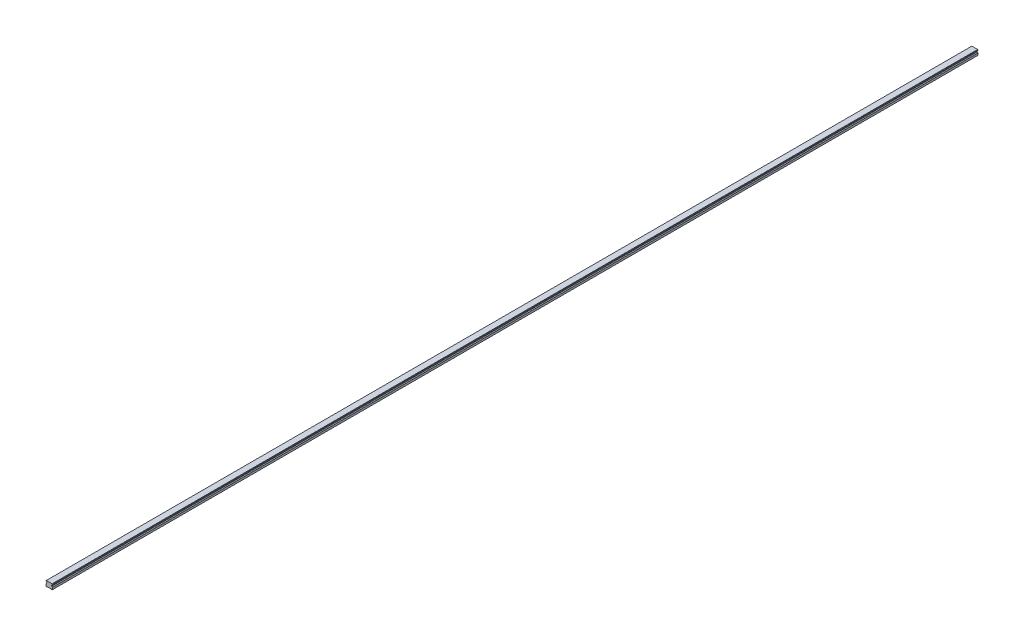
from build123d import *

# Parameters (mm, degrees)
SKETCH1_W           = 20
SKETCH1_H           = 16.3
BOSS_EXTRUDE1_DEPTH = 1430
CUT_EXTRUDE1_DEPTH  = 2861.063931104
CHAMFER1_SIZE       = 1
FILLET1_R           = 1
CUT_EXTRUDE2_DEPTH  = 2861.063931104
SKETCH5_R           = 3
SKETCH5_R_2         = 2.5
CUT_EXTRUDE5_DEPTH  = 10
SKETCH5_2_R         = 2.5
CUT_EXTRUDE6_DEPTH  = 13
LPATTERN2_COUNT     = 48
LPATTERN2_PITCH     = 60


with BuildPart() as part:
    # Sketch1 → Boss-Extrude1 (new, symmetric)
    with BuildSketch(Plane.XY):
        with Locations((0, 8.15)):
            Rectangle(SKETCH1_W, SKETCH1_H)
    extrude(amount=BOSS_EXTRUDE1_DEPTH, both=True)

    # Sketch2 → Cut-Extrude1 (cut, through all)
    with BuildSketch(Plane.XY.offset(1430)):
        Polygon((-10, 14.3), (-10, 7.3), (-7.666666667, 9.633333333), (-7.666666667, 11.966666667), align=None)
        Polygon((7.666666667, 11.966666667), (10, 14.3), (10, 7.3), (7.666666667, 9.633333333), align=None)
    extrude(amount=-CUT_EXTRUDE1_DEPTH, mode=Mode.SUBTRACT)

    # Chamfer1
    chamfer1_edges = [part.edges().sort_by_distance(p)[0] for p in [
        (-10, 16.3, 0),
        (10, 16.3, 0),
        (10, 0, 0),
        (-10, 0, 0),
    ]]
    chamfer(chamfer1_edges, length=CHAMFER1_SIZE)

    # Fillet1
    fillet1_edges = [part.edges().sort_by_distance(p)[0] for p in [
        (-7.666666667, 11.966666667, 0),
        (-7.666666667, 9.633333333, 0),
        (7.666666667, 9.633333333, 0),
        (7.666666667, 11.966666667, 0),
    ]]
    fillet(fillet1_edges, radius=FILLET1_R)

    # Sketch3 → Cut-Extrude2 (cut, through all)
    with BuildSketch(Plane.XY.offset(1430)):
        Polygon((-6, 0), (-5, 1), (5, 1), (6, 0), align=None)
    extrude(amount=-CUT_EXTRUDE2_DEPTH, mode=Mode.SUBTRACT)

    # Sketch5 → Cut-Extrude5 (cut)
    with BuildSketch(Plane.XZ.offset(-1)):
        with Locations(Location((0, 1410, 0), (0, 0, 270))):
            Circle(SKETCH5_R)
        with Locations(Location((0, 1410, 0), (0, 0, 270))):
            Circle(SKETCH5_R_2, mode=Mode.SUBTRACT)
    cut_extrude5 = extrude(amount=-CUT_EXTRUDE5_DEPTH, mode=Mode.SUBTRACT)

    # Sketch5_2 → Cut-Extrude6 (cut)
    with BuildSketch(Plane.XZ.offset(-1)):
        with Locations(Location((0, 1410, 0), (0, 0, 270))):
            Circle(SKETCH5_2_R)
    cut_extrude6 = extrude(amount=-CUT_EXTRUDE6_DEPTH, mode=Mode.SUBTRACT)

    # Cut-Extrude7 cone 1 section (on through the dimple's axis) → Cut-Extrude7 (revolve, cut)
    with BuildSketch(Plane(origin=(0, 14, 1410), x_dir=(0, 0, -1), z_dir=(1, 0, 0))):
        Polygon((0, 0), (2.5, 0), (0, 1.443375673), align=None)
    cut_extrude7 = revolve(axis=Axis((0, 14, 1410), (0, 1, 0)), mode=Mode.SUBTRACT)

    # LPattern2: Cut-Extrude5, Cut-Extrude6, Cut-Extrude7 ×48
    with Locations(*[(0, 0, -i * LPATTERN2_PITCH) for i in range(1, LPATTERN2_COUNT)]):
        add(cut_extrude5, mode=Mode.SUBTRACT)
        add(cut_extrude6, mode=Mode.SUBTRACT)
        add(cut_extrude7, mode=Mode.SUBTRACT)


solid = part.part
